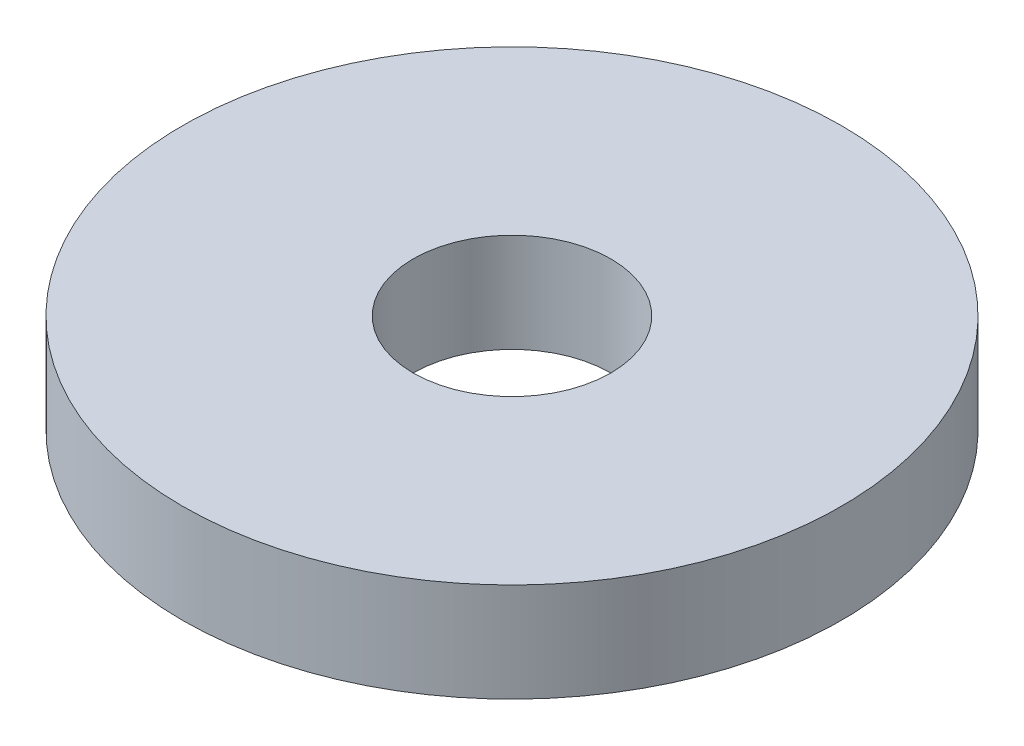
ISO-10303-21;
HEADER;
FILE_DESCRIPTION(('STEP AP214'),'2;1');
FILE_NAME('part.step','',(''),(''),'','','');
FILE_SCHEMA(('AUTOMOTIVE_DESIGN { 1 0 10303 214 1 1 1 1 }'));
ENDSEC;
DATA;
#1=APPLICATION_CONTEXT('core data for automotive mechanical design processes');
#2=APPLICATION_PROTOCOL_DEFINITION('international standard','automotive_design',2000,#1);
#3=PRODUCT_CONTEXT('',#1,'mechanical');
#4=PRODUCT('Part','Part','',(#3));
#5=PRODUCT_RELATED_PRODUCT_CATEGORY('part','',(#4));
#6=PRODUCT_DEFINITION_FORMATION('','',#4);
#7=PRODUCT_DEFINITION_CONTEXT('part definition',#1,'design');
#8=PRODUCT_DEFINITION('design','',#6,#7);
#9=PRODUCT_DEFINITION_SHAPE('','',#8);
#10=(LENGTH_UNIT() NAMED_UNIT(*) SI_UNIT(.MILLI.,.METRE.));
#11=(NAMED_UNIT(*) PLANE_ANGLE_UNIT() SI_UNIT($,.RADIAN.));
#12=(NAMED_UNIT(*) SI_UNIT($,.STERADIAN.) SOLID_ANGLE_UNIT());
#13=UNCERTAINTY_MEASURE_WITH_UNIT(LENGTH_MEASURE(1.E-05),#10,'distance_accuracy_value','');
#14=(GEOMETRIC_REPRESENTATION_CONTEXT(3) GLOBAL_UNCERTAINTY_ASSIGNED_CONTEXT((#13)) GLOBAL_UNIT_ASSIGNED_CONTEXT((#10,
#11,#12)) REPRESENTATION_CONTEXT('',''));
#15=CARTESIAN_POINT('',(0.,0.,0.));
#16=DIRECTION('',(0.,0.,1.));
#17=DIRECTION('',(1.,0.,0.));
#18=AXIS2_PLACEMENT_3D('',#15,#16,#17);
#19=CARTESIAN_POINT('',(0.,-15.,0.));
#20=DIRECTION('',(0.,1.,0.));
#21=DIRECTION('',(0.,0.,1.));
#22=AXIS2_PLACEMENT_3D('',#19,#20,#21);
#23=CYLINDRICAL_SURFACE('',#22,50.);
#24=CARTESIAN_POINT('',(0.,-15.,0.));
#25=DIRECTION('',(0.,1.,0.));
#26=DIRECTION('',(0.,0.,1.));
#27=AXIS2_PLACEMENT_3D('',#24,#25,#26);
#28=CIRCLE('',#27,50.);
#29=CARTESIAN_POINT('',(0.,-15.,50.));
#30=VERTEX_POINT('',#29);
#31=EDGE_CURVE('E10',#30,#30,#28,.T.);
#32=ORIENTED_EDGE('',*,*,#31,.T.);
#33=EDGE_LOOP('',(#32));
#34=FACE_BOUND('',#33,.T.);
#35=CARTESIAN_POINT('',(0.,0.,0.));
#36=DIRECTION('',(0.,1.,0.));
#37=DIRECTION('',(0.,0.,1.));
#38=AXIS2_PLACEMENT_3D('',#35,#36,#37);
#39=CIRCLE('',#38,50.);
#40=CARTESIAN_POINT('',(0.,0.,50.));
#41=VERTEX_POINT('',#40);
#42=EDGE_CURVE('E37',#41,#41,#39,.T.);
#43=ORIENTED_EDGE('',*,*,#42,.F.);
#44=EDGE_LOOP('',(#43));
#45=FACE_BOUND('',#44,.T.);
#46=ADVANCED_FACE('F40',(#34,#45),#23,.T.);
#47=CARTESIAN_POINT('',(0.,-15.,0.));
#48=DIRECTION('',(0.,1.,0.));
#49=DIRECTION('',(0.,0.,1.));
#50=AXIS2_PLACEMENT_3D('',#47,#48,#49);
#51=PLANE('',#50);
#52=CARTESIAN_POINT('',(0.,-15.,0.));
#53=DIRECTION('',(0.,1.,0.));
#54=DIRECTION('',(0.,0.,1.));
#55=AXIS2_PLACEMENT_3D('',#52,#53,#54);
#56=CIRCLE('',#55,15.);
#57=CARTESIAN_POINT('',(0.,-15.,15.));
#58=VERTEX_POINT('',#57);
#59=EDGE_CURVE('E50',#58,#58,#56,.T.);
#60=ORIENTED_EDGE('',*,*,#59,.T.);
#61=EDGE_LOOP('',(#60));
#62=FACE_BOUND('',#61,.T.);
#63=ORIENTED_EDGE('',*,*,#31,.F.);
#64=EDGE_LOOP('',(#63));
#65=FACE_BOUND('',#64,.T.);
#66=ADVANCED_FACE('F54',(#62,#65),#51,.F.);
#67=CARTESIAN_POINT('',(0.,0.,0.));
#68=DIRECTION('',(0.,1.,0.));
#69=DIRECTION('',(0.,0.,1.));
#70=AXIS2_PLACEMENT_3D('',#67,#68,#69);
#71=PLANE('',#70);
#72=CARTESIAN_POINT('',(0.,0.,0.));
#73=DIRECTION('',(0.,1.,0.));
#74=DIRECTION('',(0.,0.,1.));
#75=AXIS2_PLACEMENT_3D('',#72,#73,#74);
#76=CIRCLE('',#75,15.);
#77=CARTESIAN_POINT('',(0.,0.,15.));
#78=VERTEX_POINT('',#77);
#79=EDGE_CURVE('E47',#78,#78,#76,.T.);
#80=ORIENTED_EDGE('',*,*,#79,.F.);
#81=EDGE_LOOP('',(#80));
#82=FACE_BOUND('',#81,.T.);
#83=ORIENTED_EDGE('',*,*,#42,.T.);
#84=EDGE_LOOP('',(#83));
#85=FACE_BOUND('',#84,.T.);
#86=ADVANCED_FACE('F63',(#82,#85),#71,.T.);
#87=CARTESIAN_POINT('',(0.,-15.,0.));
#88=DIRECTION('',(0.,1.,0.));
#89=DIRECTION('',(0.,0.,1.));
#90=AXIS2_PLACEMENT_3D('',#87,#88,#89);
#91=CYLINDRICAL_SURFACE('',#90,15.);
#92=ORIENTED_EDGE('',*,*,#59,.F.);
#93=EDGE_LOOP('',(#92));
#94=FACE_BOUND('',#93,.T.);
#95=ORIENTED_EDGE('',*,*,#79,.T.);
#96=EDGE_LOOP('',(#95));
#97=FACE_BOUND('',#96,.T.);
#98=ADVANCED_FACE('F59',(#94,#97),#91,.F.);
#99=CLOSED_SHELL('',(#46,#66,#86,#98));
#100=MANIFOLD_SOLID_BREP('B2',#99);
#101=ADVANCED_BREP_SHAPE_REPRESENTATION('',(#18,#100),#14);
#102=SHAPE_DEFINITION_REPRESENTATION(#9,#101);
ENDSEC;
END-ISO-10303-21;
